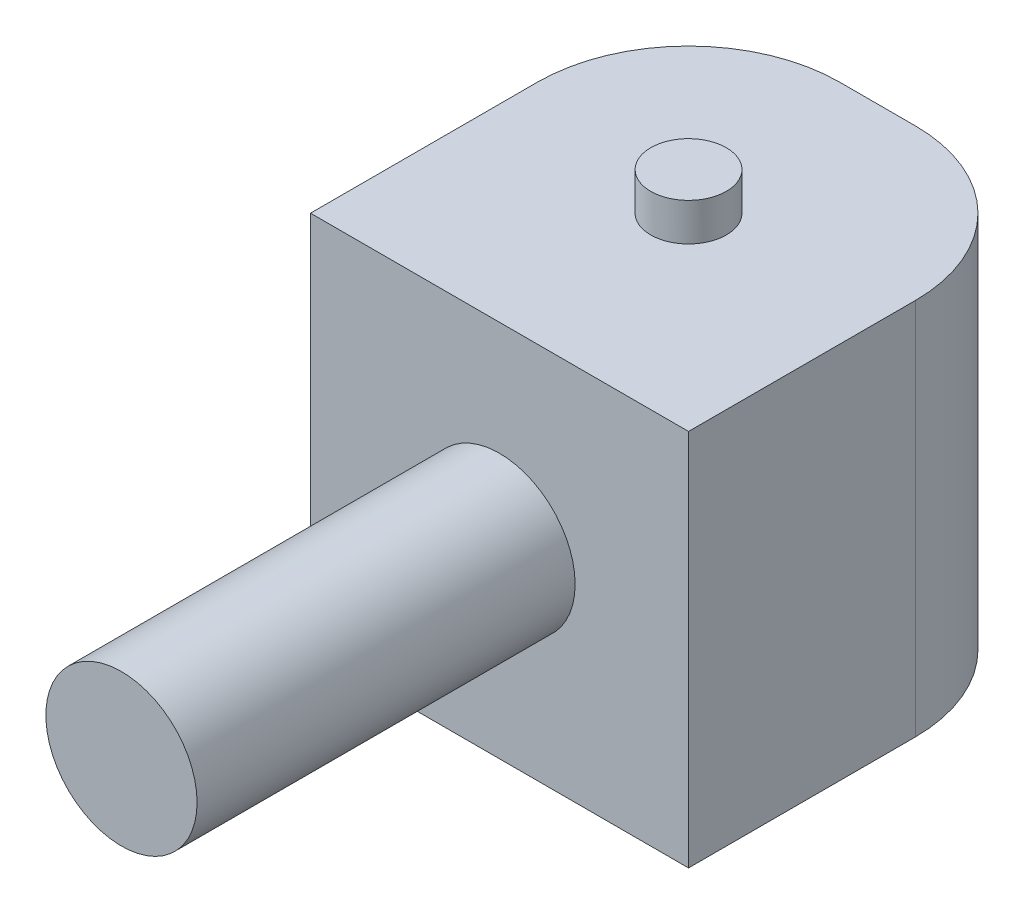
from build123d import *

# Parameters (mm, degrees)
SKETCH1_W           = 2.54
SKETCH1_H           = 2.54
BOSS_EXTRUDE1_DEPTH = 2.54
SKETCH3_R           = 0.508
BOSS_EXTRUDE2_DEPTH = 2.54
SKETCH4_R           = 0.254
BOSS_EXTRUDE3_DEPTH = 0.254
FILLET1_R           = 1.016


with BuildPart() as part:
    # Sketch1 → Boss-Extrude1 (new body)
    with BuildSketch(Plane.XY):
        Rectangle(SKETCH1_W, SKETCH1_H)
    extrude(amount=-BOSS_EXTRUDE1_DEPTH)

    # Sketch3 → Boss-Extrude2 (add)
    with BuildSketch(Plane.XY):
        Circle(SKETCH3_R)
    extrude(amount=BOSS_EXTRUDE2_DEPTH)

    # Sketch4 → Boss-Extrude3 (add)
    with BuildSketch(Plane.XZ.offset(1.27)):
        with Locations(Location((0, -1.27, 0), (0, 0, 270))):
            Circle(SKETCH4_R)
    boss_extrude3 = extrude(amount=BOSS_EXTRUDE3_DEPTH)

    # Mirror1: Boss-Extrude3 across plane
    add(boss_extrude3.mirror(Plane.ZX))

    # Sketch6 → Revolve1 (revolve)
    with BuildSketch(Plane(origin=(0, 0, 0), x_dir=(1, 0, 0), z_dir=(0, 1, 0))):
        with BuildLine():
            Line((0, 2.54), (0, 2.7178))
            ThreePointArc((0, 2.7178), (0.125723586, 2.665723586), (0.1778, 2.54))
            Line((0.1778, 2.54), (0, 2.54))
        make_face()
    revolve(axis=Axis((0, 0, -2.54), (0, 0, -1)))

    # Fillet1
    fillet1_edges = [part.edges().sort_by_distance(p)[0] for p in [
        (-1.27, 0, -2.54),
        (1.27, 0, -2.54),
    ]]
    fillet(fillet1_edges, radius=FILLET1_R)


solid = part.part
